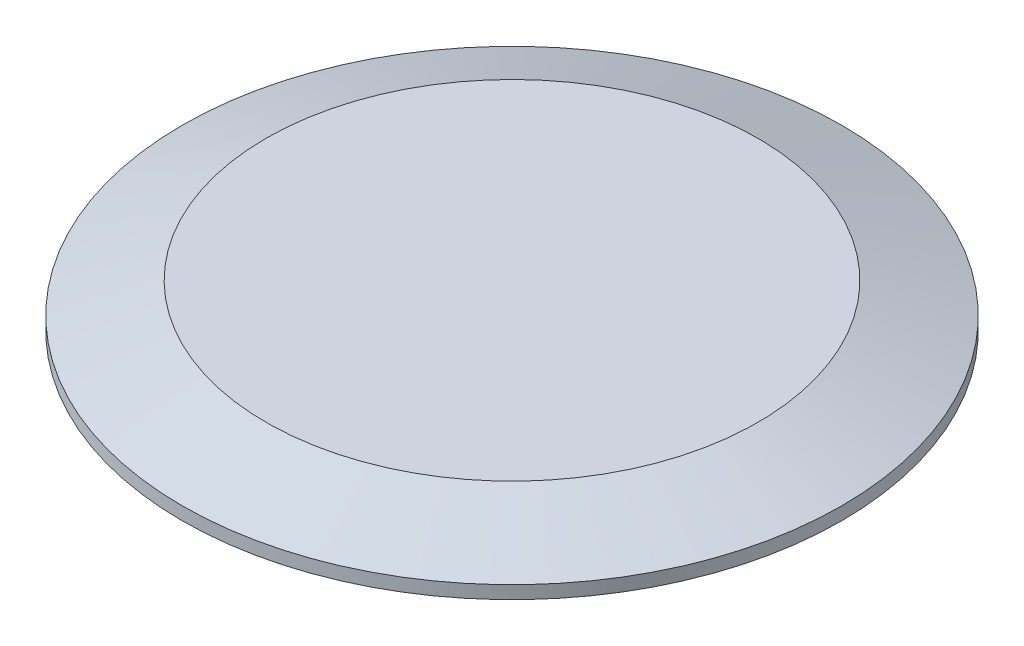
from build123d import *


with BuildPart() as part:
    # Sketch1 → Revolve1 (revolve)
    with BuildSketch(Plane.XY):
        with BuildLine():
            Line((0, 0), (-65.644391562, 0))
            ThreePointArc((-65.644391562, 0), (-66.076588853, 0.129217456), (-66.366933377, 0.474458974))
            ThreePointArc((-66.366933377, 0.474458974), (-67.4624, 1.1938), (-68.557866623, 0.474458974))
            ThreePointArc((-68.557866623, 0.474458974), (-68.848211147, 0.129217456), (-69.280408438, 0))
            Line((-69.280408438, 0), (-72.2884, 0))
            Line((-72.2884, 0), (-72.2884, 2.8448))
            Line((-72.2884, 2.8448), (-53.934701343, 9.525))
            Line((-53.934701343, 9.525), (0, 9.525))
            Line((0, 9.525), (0, 0))
        make_face()
    revolve(axis=Axis((0, 9.525, 0), (0, -1, 0)))


solid = part.part
